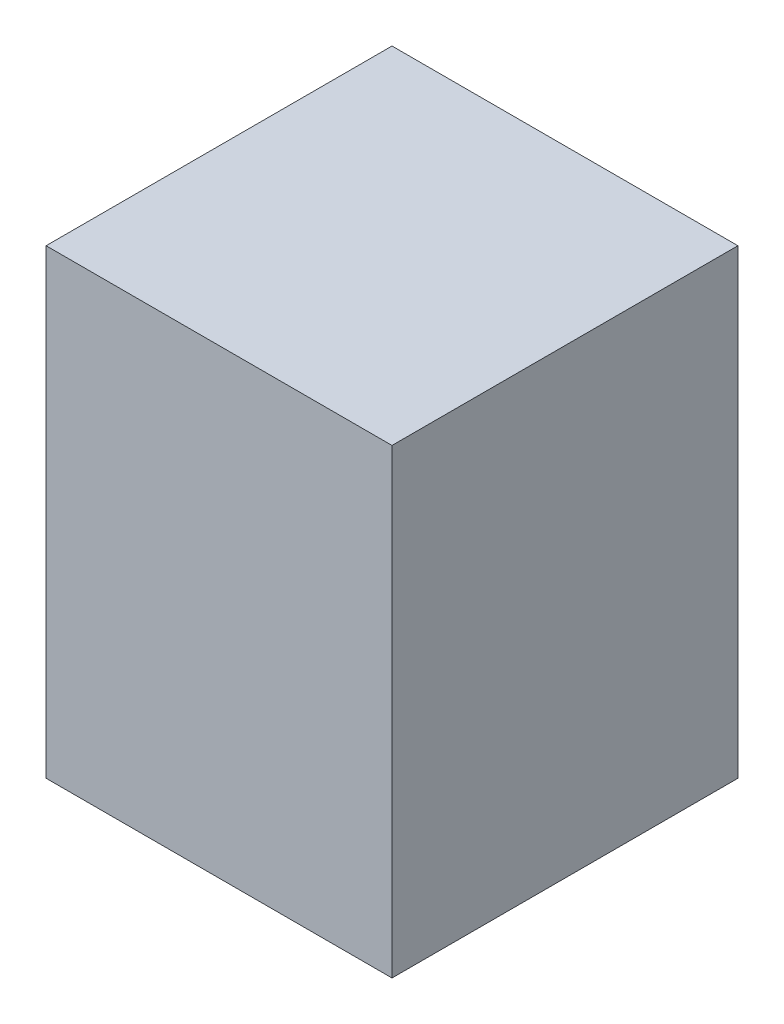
ISO-10303-21;
HEADER;
FILE_DESCRIPTION(('STEP AP214'),'2;1');
FILE_NAME('part.step','',(''),(''),'','','');
FILE_SCHEMA(('AUTOMOTIVE_DESIGN { 1 0 10303 214 1 1 1 1 }'));
ENDSEC;
DATA;
#1=APPLICATION_CONTEXT('core data for automotive mechanical design processes');
#2=APPLICATION_PROTOCOL_DEFINITION('international standard','automotive_design',2000,#1);
#3=PRODUCT_CONTEXT('',#1,'mechanical');
#4=PRODUCT('Part','Part','',(#3));
#5=PRODUCT_RELATED_PRODUCT_CATEGORY('part','',(#4));
#6=PRODUCT_DEFINITION_FORMATION('','',#4);
#7=PRODUCT_DEFINITION_CONTEXT('part definition',#1,'design');
#8=PRODUCT_DEFINITION('design','',#6,#7);
#9=PRODUCT_DEFINITION_SHAPE('','',#8);
#10=(LENGTH_UNIT() NAMED_UNIT(*) SI_UNIT(.MILLI.,.METRE.));
#11=(NAMED_UNIT(*) PLANE_ANGLE_UNIT() SI_UNIT($,.RADIAN.));
#12=(NAMED_UNIT(*) SI_UNIT($,.STERADIAN.) SOLID_ANGLE_UNIT());
#13=UNCERTAINTY_MEASURE_WITH_UNIT(LENGTH_MEASURE(1.E-05),#10,'distance_accuracy_value','');
#14=(GEOMETRIC_REPRESENTATION_CONTEXT(3) GLOBAL_UNCERTAINTY_ASSIGNED_CONTEXT((#13)) GLOBAL_UNIT_ASSIGNED_CONTEXT((#10,
#11,#12)) REPRESENTATION_CONTEXT('',''));
#15=CARTESIAN_POINT('',(0.,0.,0.));
#16=DIRECTION('',(0.,0.,1.));
#17=DIRECTION('',(1.,0.,0.));
#18=AXIS2_PLACEMENT_3D('',#15,#16,#17);
#19=CARTESIAN_POINT('',(135.,0.,22.5));
#20=DIRECTION('',(1.,0.,0.));
#21=DIRECTION('',(0.,0.,-1.));
#22=AXIS2_PLACEMENT_3D('',#19,#20,#21);
#23=PLANE('',#22);
#24=DIRECTION('',(0.,-1.,0.));
#25=VECTOR('',#24,1.);
#26=CARTESIAN_POINT('',(135.,0.,0.));
#27=LINE('',#26,#25);
#28=CARTESIAN_POINT('',(135.,0.,0.));
#29=VERTEX_POINT('',#28);
#30=CARTESIAN_POINT('',(135.,-30.,0.));
#31=VERTEX_POINT('',#30);
#32=EDGE_CURVE('E70',#29,#31,#27,.T.);
#33=ORIENTED_EDGE('',*,*,#32,.T.);
#34=DIRECTION('',(0.,0.,-1.));
#35=VECTOR('',#34,1.);
#36=CARTESIAN_POINT('',(135.,-30.,22.5));
#37=LINE('',#36,#35);
#38=CARTESIAN_POINT('',(135.,-30.,22.5));
#39=VERTEX_POINT('',#38);
#40=EDGE_CURVE('E11',#39,#31,#37,.T.);
#41=ORIENTED_EDGE('',*,*,#40,.F.);
#42=DIRECTION('',(0.,-1.,0.));
#43=VECTOR('',#42,1.);
#44=CARTESIAN_POINT('',(135.,0.,22.5));
#45=LINE('',#44,#43);
#46=CARTESIAN_POINT('',(135.,0.,22.5));
#47=VERTEX_POINT('',#46);
#48=EDGE_CURVE('E88',#47,#39,#45,.T.);
#49=ORIENTED_EDGE('',*,*,#48,.F.);
#50=DIRECTION('',(0.,0.,-1.));
#51=VECTOR('',#50,1.);
#52=CARTESIAN_POINT('',(135.,0.,22.5));
#53=LINE('',#52,#51);
#54=EDGE_CURVE('E82',#47,#29,#53,.T.);
#55=ORIENTED_EDGE('',*,*,#54,.T.);
#56=EDGE_LOOP('',(#33,#41,#49,#55));
#57=FACE_BOUND('',#56,.T.);
#58=ADVANCED_FACE('F26',(#57),#23,.F.);
#59=CARTESIAN_POINT('',(135.,-30.,22.5));
#60=DIRECTION('',(0.,1.,0.));
#61=DIRECTION('',(0.,0.,1.));
#62=AXIS2_PLACEMENT_3D('',#59,#60,#61);
#63=PLANE('',#62);
#64=DIRECTION('',(1.,0.,0.));
#65=VECTOR('',#64,1.);
#66=CARTESIAN_POINT('',(135.,-30.,0.));
#67=LINE('',#66,#65);
#68=CARTESIAN_POINT('',(157.5,-30.,0.));
#69=VERTEX_POINT('',#68);
#70=EDGE_CURVE('E66',#31,#69,#67,.T.);
#71=ORIENTED_EDGE('',*,*,#70,.T.);
#72=DIRECTION('',(0.,0.,-1.));
#73=VECTOR('',#72,1.);
#74=CARTESIAN_POINT('',(157.5,-30.,22.5));
#75=LINE('',#74,#73);
#76=CARTESIAN_POINT('',(157.5,-30.,22.5));
#77=VERTEX_POINT('',#76);
#78=EDGE_CURVE('E33',#77,#69,#75,.T.);
#79=ORIENTED_EDGE('',*,*,#78,.F.);
#80=DIRECTION('',(1.,0.,0.));
#81=VECTOR('',#80,1.);
#82=CARTESIAN_POINT('',(135.,-30.,22.5));
#83=LINE('',#82,#81);
#84=EDGE_CURVE('E78',#39,#77,#83,.T.);
#85=ORIENTED_EDGE('',*,*,#84,.F.);
#86=ORIENTED_EDGE('',*,*,#40,.T.);
#87=EDGE_LOOP('',(#71,#79,#85,#86));
#88=FACE_BOUND('',#87,.T.);
#89=ADVANCED_FACE('F77',(#88),#63,.F.);
#90=CARTESIAN_POINT('',(157.5,0.,22.5));
#91=DIRECTION('',(-1.,0.,0.));
#92=DIRECTION('',(0.,0.,1.));
#93=AXIS2_PLACEMENT_3D('',#90,#91,#92);
#94=PLANE('',#93);
#95=DIRECTION('',(0.,1.,0.));
#96=VECTOR('',#95,1.);
#97=CARTESIAN_POINT('',(157.5,0.,0.));
#98=LINE('',#97,#96);
#99=CARTESIAN_POINT('',(157.5,0.,0.));
#100=VERTEX_POINT('',#99);
#101=EDGE_CURVE('E71',#69,#100,#98,.T.);
#102=ORIENTED_EDGE('',*,*,#101,.T.);
#103=DIRECTION('',(0.,0.,-1.));
#104=VECTOR('',#103,1.);
#105=CARTESIAN_POINT('',(157.5,0.,22.5));
#106=LINE('',#105,#104);
#107=CARTESIAN_POINT('',(157.5,0.,22.5));
#108=VERTEX_POINT('',#107);
#109=EDGE_CURVE('E94',#108,#100,#106,.T.);
#110=ORIENTED_EDGE('',*,*,#109,.F.);
#111=DIRECTION('',(0.,1.,0.));
#112=VECTOR('',#111,1.);
#113=CARTESIAN_POINT('',(157.5,0.,22.5));
#114=LINE('',#113,#112);
#115=EDGE_CURVE('E45',#77,#108,#114,.T.);
#116=ORIENTED_EDGE('',*,*,#115,.F.);
#117=ORIENTED_EDGE('',*,*,#78,.T.);
#118=EDGE_LOOP('',(#102,#110,#116,#117));
#119=FACE_BOUND('',#118,.T.);
#120=ADVANCED_FACE('F97',(#119),#94,.F.);
#121=CARTESIAN_POINT('',(135.,0.,22.5));
#122=DIRECTION('',(0.,-1.,0.));
#123=DIRECTION('',(0.,0.,-1.));
#124=AXIS2_PLACEMENT_3D('',#121,#122,#123);
#125=PLANE('',#124);
#126=DIRECTION('',(-1.,0.,0.));
#127=VECTOR('',#126,1.);
#128=CARTESIAN_POINT('',(135.,0.,0.));
#129=LINE('',#128,#127);
#130=EDGE_CURVE('E86',#100,#29,#129,.T.);
#131=ORIENTED_EDGE('',*,*,#130,.T.);
#132=ORIENTED_EDGE('',*,*,#54,.F.);
#133=DIRECTION('',(-1.,0.,0.));
#134=VECTOR('',#133,1.);
#135=CARTESIAN_POINT('',(135.,0.,22.5));
#136=LINE('',#135,#134);
#137=EDGE_CURVE('E40',#108,#47,#136,.T.);
#138=ORIENTED_EDGE('',*,*,#137,.F.);
#139=ORIENTED_EDGE('',*,*,#109,.T.);
#140=EDGE_LOOP('',(#131,#132,#138,#139));
#141=FACE_BOUND('',#140,.T.);
#142=ADVANCED_FACE('F99',(#141),#125,.F.);
#143=CARTESIAN_POINT('',(135.,-30.,22.5));
#144=DIRECTION('',(0.,0.,1.));
#145=DIRECTION('',(1.,0.,0.));
#146=AXIS2_PLACEMENT_3D('',#143,#144,#145);
#147=PLANE('',#146);
#148=ORIENTED_EDGE('',*,*,#48,.T.);
#149=ORIENTED_EDGE('',*,*,#84,.T.);
#150=ORIENTED_EDGE('',*,*,#115,.T.);
#151=ORIENTED_EDGE('',*,*,#137,.T.);
#152=EDGE_LOOP('',(#148,#149,#150,#151));
#153=FACE_BOUND('',#152,.T.);
#154=ADVANCED_FACE('F100',(#153),#147,.T.);
#155=CARTESIAN_POINT('',(135.,-30.,0.));
#156=DIRECTION('',(0.,0.,1.));
#157=DIRECTION('',(1.,0.,0.));
#158=AXIS2_PLACEMENT_3D('',#155,#156,#157);
#159=PLANE('',#158);
#160=ORIENTED_EDGE('',*,*,#32,.F.);
#161=ORIENTED_EDGE('',*,*,#130,.F.);
#162=ORIENTED_EDGE('',*,*,#101,.F.);
#163=ORIENTED_EDGE('',*,*,#70,.F.);
#164=EDGE_LOOP('',(#160,#161,#162,#163));
#165=FACE_BOUND('',#164,.T.);
#166=ADVANCED_FACE('F67',(#165),#159,.F.);
#167=CLOSED_SHELL('',(#58,#89,#120,#142,#154,#166));
#168=MANIFOLD_SOLID_BREP('B2',#167);
#169=ADVANCED_BREP_SHAPE_REPRESENTATION('',(#18,#168),#14);
#170=SHAPE_DEFINITION_REPRESENTATION(#9,#169);
ENDSEC;
END-ISO-10303-21;
